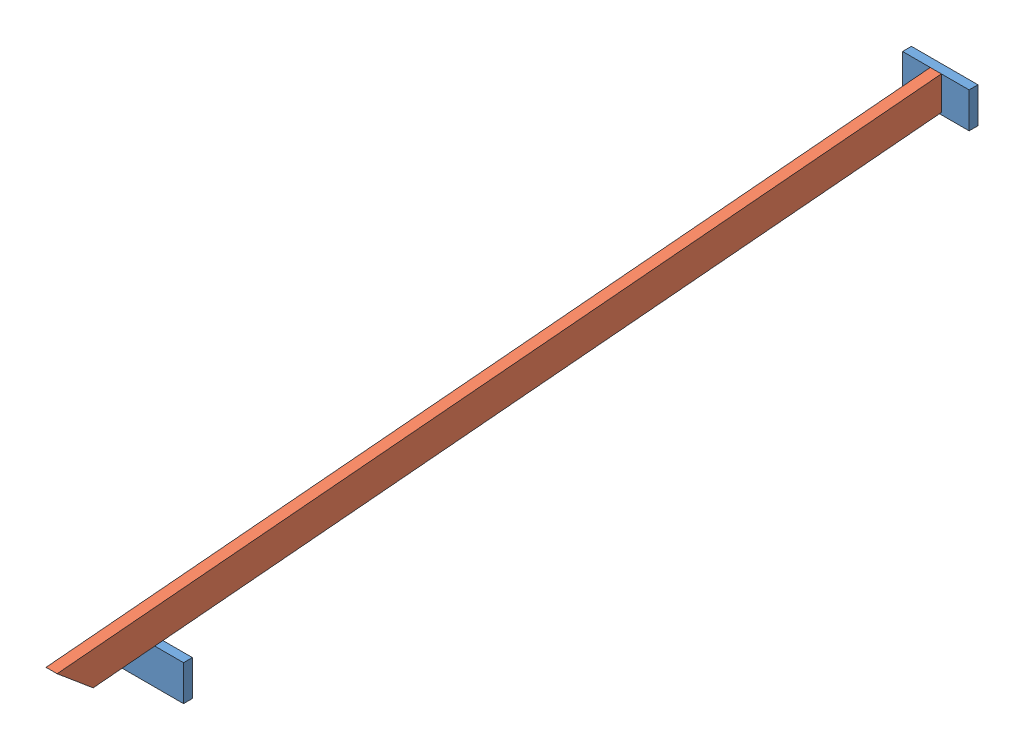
SolidWorks assembly Baugruppe1.sldasm, configuration Standard (file format 6000). Lengths in mm.
Overall size (300 625.3 4024.78).
3 component instances, 2 part files, 6 mates.
Components (placement in the parent):
- Auflage_Anlage schmetaisch-1: Auflage_Anlage schmetaisch.SLDPRT [Standard] at (-32.5046 -54.938 20) size (300 160 40)
- Auflage_Anlage schmetaisch-2: Auflage_Anlage schmetaisch.SLDPRT [Standard] at (-32.5046 -520.2399 3560) size (300 160 40)
- Sparren L 4000-1: Sparren L 4000.SLDPRT [Standard] at (-57.5046 -218.6787 1999.316) x (1 0 0) z (0 -0.087156 0.996195) size (50 150 4000)
Mates (geometry in assembly coordinates):
- Deckungsgleich1: coincident aligned: plane of Auflage_Anlage schmetaisch-1 through (117.4954 -54.938 20) normal (1 0 0); plane of Auflage_Anlage schmetaisch-2 through (117.4954 -441.7878 2663.2874) normal (1 0 0)
- Deckungsgleich3: coincident anti-aligned: plane of Auflage_Anlage schmetaisch-1 through (117.4954 -54.938 20) normal (0 0 1); plane of Sparren L 4000-1 through (-57.5046 -45.511 20) normal (0 0 -1)
- Deckungsgleich4: coincident aligned: line of Auflage_Anlage schmetaisch-1 through (117.4954 105.062 20) axis (-1 0 0); line of Sparren L 4000-1 through (-7.5046 105.062 20) axis (-1 0 0)
- Abstand1: distance = 125 mm aligned: plane of Sparren L 4000-1 through (-7.5046 -392.9902 3991.7054) normal (1 0 0); plane of Auflage_Anlage schmetaisch-1 through (117.4954 -54.938 20) normal (1 0 0)
- Abstand2: distance = 5 mm: line of Auflage_Anlage schmetaisch-2 through (117.4954 -360.2399 3560) axis (-1 0 0); plane of Sparren L 4000-1 through (-57.5046 -392.9902 3991.7054) normal (0 -0.996195 -0.087156)
- Abstand3: distance = 3500 mm anti-aligned: plane of Auflage_Anlage schmetaisch-2 through (117.4954 -520.2399 3520) normal (0 0 -1); plane of Auflage_Anlage schmetaisch-1 through (117.4954 -54.938 20) normal (0 0 1)
